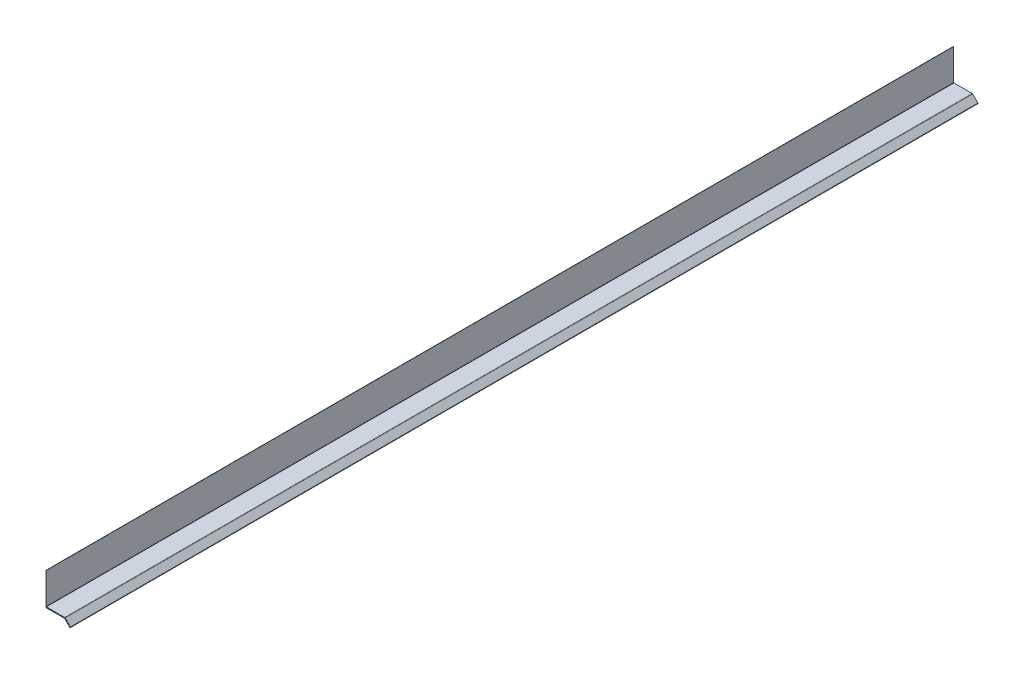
ISO-10303-21;
HEADER;
FILE_DESCRIPTION(('STEP AP214'),'2;1');
FILE_NAME('part.step','',(''),(''),'','','');
FILE_SCHEMA(('AUTOMOTIVE_DESIGN { 1 0 10303 214 1 1 1 1 }'));
ENDSEC;
DATA;
#1=APPLICATION_CONTEXT('core data for automotive mechanical design processes');
#2=APPLICATION_PROTOCOL_DEFINITION('international standard','automotive_design',2000,#1);
#3=PRODUCT_CONTEXT('',#1,'mechanical');
#4=PRODUCT('Part','Part','',(#3));
#5=PRODUCT_RELATED_PRODUCT_CATEGORY('part','',(#4));
#6=PRODUCT_DEFINITION_FORMATION('','',#4);
#7=PRODUCT_DEFINITION_CONTEXT('part definition',#1,'design');
#8=PRODUCT_DEFINITION('design','',#6,#7);
#9=PRODUCT_DEFINITION_SHAPE('','',#8);
#10=(LENGTH_UNIT() NAMED_UNIT(*) SI_UNIT(.MILLI.,.METRE.));
#11=(NAMED_UNIT(*) PLANE_ANGLE_UNIT() SI_UNIT($,.RADIAN.));
#12=(NAMED_UNIT(*) SI_UNIT($,.STERADIAN.) SOLID_ANGLE_UNIT());
#13=UNCERTAINTY_MEASURE_WITH_UNIT(LENGTH_MEASURE(1.E-05),#10,'distance_accuracy_value','');
#14=(GEOMETRIC_REPRESENTATION_CONTEXT(3) GLOBAL_UNCERTAINTY_ASSIGNED_CONTEXT((#13)) GLOBAL_UNIT_ASSIGNED_CONTEXT((#10,
#11,#12)) REPRESENTATION_CONTEXT('',''));
#15=CARTESIAN_POINT('',(0.,0.,0.));
#16=DIRECTION('',(0.,0.,1.));
#17=DIRECTION('',(1.,0.,0.));
#18=AXIS2_PLACEMENT_3D('',#15,#16,#17);
#19=CARTESIAN_POINT('',(41.0712069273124,-0.999999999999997,2000.));
#20=DIRECTION('',(0.,-1.,0.));
#21=DIRECTION('',(1.,0.,0.));
#22=AXIS2_PLACEMENT_3D('',#19,#20,#21);
#23=PLANE('',#22);
#24=DIRECTION('',(-1.,0.,0.));
#25=VECTOR('',#24,1.);
#26=CARTESIAN_POINT('',(41.0712069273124,-0.999999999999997,0.));
#27=LINE('',#26,#25);
#28=CARTESIAN_POINT('',(41.0712069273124,-0.999999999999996,0.));
#29=VERTEX_POINT('',#28);
#30=CARTESIAN_POINT('',(0.363113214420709,-1.,0.));
#31=VERTEX_POINT('',#30);
#32=EDGE_CURVE('E194',#29,#31,#27,.T.);
#33=ORIENTED_EDGE('',*,*,#32,.T.);
#34=DIRECTION('',(0.,0.,-1.));
#35=VECTOR('',#34,1.);
#36=CARTESIAN_POINT('',(0.363113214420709,-1.,2000.));
#37=LINE('',#36,#35);
#38=CARTESIAN_POINT('',(0.363113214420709,-1.,2000.));
#39=VERTEX_POINT('',#38);
#40=EDGE_CURVE('E11',#39,#31,#37,.T.);
#41=ORIENTED_EDGE('',*,*,#40,.F.);
#42=DIRECTION('',(-1.,0.,0.));
#43=VECTOR('',#42,1.);
#44=CARTESIAN_POINT('',(41.0712069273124,-0.999999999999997,2000.));
#45=LINE('',#44,#43);
#46=CARTESIAN_POINT('',(41.0712069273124,-0.999999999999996,2000.));
#47=VERTEX_POINT('',#46);
#48=EDGE_CURVE('E122',#47,#39,#45,.T.);
#49=ORIENTED_EDGE('',*,*,#48,.F.);
#50=DIRECTION('',(0.,0.,-1.));
#51=VECTOR('',#50,1.);
#52=CARTESIAN_POINT('',(41.0712069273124,-0.999999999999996,2000.));
#53=LINE('',#52,#51);
#54=EDGE_CURVE('E190',#47,#29,#53,.T.);
#55=ORIENTED_EDGE('',*,*,#54,.T.);
#56=EDGE_LOOP('',(#33,#41,#49,#55));
#57=FACE_BOUND('',#56,.T.);
#58=ADVANCED_FACE('F33',(#57),#23,.F.);
#59=CARTESIAN_POINT('',(0.363113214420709,-1.508,2000.));
#60=DIRECTION('',(-1.,0.,0.));
#61=DIRECTION('',(0.,0.,1.));
#62=AXIS2_PLACEMENT_3D('',#59,#60,#61);
#63=PLANE('',#62);
#64=DIRECTION('',(0.,1.,0.));
#65=VECTOR('',#64,1.);
#66=CARTESIAN_POINT('',(0.363113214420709,-1.508,0.));
#67=LINE('',#66,#65);
#68=CARTESIAN_POINT('',(0.363113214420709,-1.508,0.));
#69=VERTEX_POINT('',#68);
#70=EDGE_CURVE('E197',#69,#31,#67,.T.);
#71=ORIENTED_EDGE('',*,*,#70,.F.);
#72=DIRECTION('',(0.,0.,-1.));
#73=VECTOR('',#72,1.);
#74=CARTESIAN_POINT('',(0.363113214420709,-1.508,2000.));
#75=LINE('',#74,#73);
#76=CARTESIAN_POINT('',(0.363113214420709,-1.508,2000.));
#77=VERTEX_POINT('',#76);
#78=EDGE_CURVE('E41',#77,#69,#75,.T.);
#79=ORIENTED_EDGE('',*,*,#78,.F.);
#80=DIRECTION('',(0.,1.,0.));
#81=VECTOR('',#80,1.);
#82=CARTESIAN_POINT('',(0.363113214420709,-1.508,2000.));
#83=LINE('',#82,#81);
#84=EDGE_CURVE('E294',#77,#39,#83,.T.);
#85=ORIENTED_EDGE('',*,*,#84,.T.);
#86=ORIENTED_EDGE('',*,*,#40,.T.);
#87=EDGE_LOOP('',(#71,#79,#85,#86));
#88=FACE_BOUND('',#87,.T.);
#89=ADVANCED_FACE('F281',(#88),#63,.T.);
#90=CARTESIAN_POINT('',(41.0712069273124,-1.508,2000.));
#91=DIRECTION('',(0.,-1.,0.));
#92=DIRECTION('',(1.,0.,0.));
#93=AXIS2_PLACEMENT_3D('',#90,#91,#92);
#94=PLANE('',#93);
#95=DIRECTION('',(-1.,0.,0.));
#96=VECTOR('',#95,1.);
#97=CARTESIAN_POINT('',(41.0712069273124,-1.508,0.));
#98=LINE('',#97,#96);
#99=CARTESIAN_POINT('',(41.0712069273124,-1.508,0.));
#100=VERTEX_POINT('',#99);
#101=EDGE_CURVE('E200',#100,#69,#98,.T.);
#102=ORIENTED_EDGE('',*,*,#101,.F.);
#103=DIRECTION('',(0.,0.,-1.));
#104=VECTOR('',#103,1.);
#105=CARTESIAN_POINT('',(41.0712069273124,-1.508,2000.));
#106=LINE('',#105,#104);
#107=CARTESIAN_POINT('',(41.0712069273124,-1.508,2000.));
#108=VERTEX_POINT('',#107);
#109=EDGE_CURVE('E271',#108,#100,#106,.T.);
#110=ORIENTED_EDGE('',*,*,#109,.F.);
#111=DIRECTION('',(-1.,0.,0.));
#112=VECTOR('',#111,1.);
#113=CARTESIAN_POINT('',(41.0712069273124,-1.508,2000.));
#114=LINE('',#113,#112);
#115=EDGE_CURVE('E278',#108,#77,#114,.T.);
#116=ORIENTED_EDGE('',*,*,#115,.T.);
#117=ORIENTED_EDGE('',*,*,#78,.T.);
#118=EDGE_LOOP('',(#102,#110,#116,#117));
#119=FACE_BOUND('',#118,.T.);
#120=ADVANCED_FACE('F276',(#119),#94,.T.);
#121=CARTESIAN_POINT('',(52.2965270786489,-12.7333201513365,2000.));
#122=DIRECTION('',(-0.707106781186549,-0.707106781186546,0.));
#123=DIRECTION('',(0.707106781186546,-0.707106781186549,0.));
#124=AXIS2_PLACEMENT_3D('',#121,#122,#123);
#125=PLANE('',#124);
#126=DIRECTION('',(-0.707106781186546,0.707106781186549,0.));
#127=VECTOR('',#126,1.);
#128=CARTESIAN_POINT('',(52.2965270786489,-12.7333201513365,0.));
#129=LINE('',#128,#127);
#130=CARTESIAN_POINT('',(52.2965270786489,-12.7333201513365,0.));
#131=VERTEX_POINT('',#130);
#132=EDGE_CURVE('E203',#131,#100,#129,.T.);
#133=ORIENTED_EDGE('',*,*,#132,.F.);
#134=DIRECTION('',(0.,0.,-1.));
#135=VECTOR('',#134,1.);
#136=CARTESIAN_POINT('',(52.2965270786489,-12.7333201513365,2000.));
#137=LINE('',#136,#135);
#138=CARTESIAN_POINT('',(52.2965270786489,-12.7333201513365,2000.));
#139=VERTEX_POINT('',#138);
#140=EDGE_CURVE('E269',#139,#131,#137,.T.);
#141=ORIENTED_EDGE('',*,*,#140,.F.);
#142=DIRECTION('',(-0.707106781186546,0.707106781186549,0.));
#143=VECTOR('',#142,1.);
#144=CARTESIAN_POINT('',(52.2965270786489,-12.7333201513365,2000.));
#145=LINE('',#144,#143);
#146=EDGE_CURVE('E291',#139,#108,#145,.T.);
#147=ORIENTED_EDGE('',*,*,#146,.T.);
#148=ORIENTED_EDGE('',*,*,#109,.T.);
#149=EDGE_LOOP('',(#133,#141,#147,#148));
#150=FACE_BOUND('',#149,.T.);
#151=ADVANCED_FACE('F288',(#150),#125,.T.);
#152=CARTESIAN_POINT('',(53.0092907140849,-12.0205565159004,2000.));
#153=DIRECTION('',(0.,0.,-1.));
#154=DIRECTION('',(-1.,0.,0.));
#155=AXIS2_PLACEMENT_3D('',#152,#153,#154);
#156=CYLINDRICAL_SURFACE('',#155,1.008);
#157=CARTESIAN_POINT('',(53.0092907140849,-12.0205565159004,0.));
#158=DIRECTION('',(0.,0.,1.));
#159=DIRECTION('',(1.,0.,0.));
#160=AXIS2_PLACEMENT_3D('',#157,#158,#159);
#161=CIRCLE('',#160,1.008);
#162=CARTESIAN_POINT('',(53.7220543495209,-11.3077928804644,0.));
#163=VERTEX_POINT('',#162);
#164=EDGE_CURVE('E206',#163,#131,#161,.F.);
#165=ORIENTED_EDGE('',*,*,#164,.F.);
#166=DIRECTION('',(0.,0.,-1.));
#167=VECTOR('',#166,1.);
#168=CARTESIAN_POINT('',(53.7220543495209,-11.3077928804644,2000.));
#169=LINE('',#168,#167);
#170=CARTESIAN_POINT('',(53.7220543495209,-11.3077928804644,2000.));
#171=VERTEX_POINT('',#170);
#172=EDGE_CURVE('E267',#171,#163,#169,.T.);
#173=ORIENTED_EDGE('',*,*,#172,.F.);
#174=CARTESIAN_POINT('',(53.0092907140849,-12.0205565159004,2000.));
#175=DIRECTION('',(0.,0.,1.));
#176=DIRECTION('',(1.,0.,0.));
#177=AXIS2_PLACEMENT_3D('',#174,#175,#176);
#178=CIRCLE('',#177,1.008);
#179=EDGE_CURVE('E296',#171,#139,#178,.F.);
#180=ORIENTED_EDGE('',*,*,#179,.T.);
#181=ORIENTED_EDGE('',*,*,#140,.T.);
#182=EDGE_LOOP('',(#165,#173,#180,#181));
#183=FACE_BOUND('',#182,.T.);
#184=ADVANCED_FACE('F359',(#183),#156,.T.);
#185=CARTESIAN_POINT('',(42.3526307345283,0.061630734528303,2000.));
#186=DIRECTION('',(0.707106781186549,0.707106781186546,0.));
#187=DIRECTION('',(-0.707106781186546,0.707106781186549,0.));
#188=AXIS2_PLACEMENT_3D('',#185,#186,#187);
#189=PLANE('',#188);
#190=DIRECTION('',(0.707106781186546,-0.707106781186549,0.));
#191=VECTOR('',#190,1.);
#192=CARTESIAN_POINT('',(42.3526307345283,0.061630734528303,0.));
#193=LINE('',#192,#191);
#194=CARTESIAN_POINT('',(42.3526307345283,0.061630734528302,0.));
#195=VERTEX_POINT('',#194);
#196=EDGE_CURVE('E209',#195,#163,#193,.T.);
#197=ORIENTED_EDGE('',*,*,#196,.F.);
#198=DIRECTION('',(0.,0.,-1.));
#199=VECTOR('',#198,1.);
#200=CARTESIAN_POINT('',(42.3526307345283,0.061630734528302,2000.));
#201=LINE('',#200,#199);
#202=CARTESIAN_POINT('',(42.3526307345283,0.061630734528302,2000.));
#203=VERTEX_POINT('',#202);
#204=EDGE_CURVE('E265',#203,#195,#201,.T.);
#205=ORIENTED_EDGE('',*,*,#204,.F.);
#206=DIRECTION('',(0.707106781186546,-0.707106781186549,0.));
#207=VECTOR('',#206,1.);
#208=CARTESIAN_POINT('',(42.3526307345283,0.061630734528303,2000.));
#209=LINE('',#208,#207);
#210=EDGE_CURVE('E302',#203,#171,#209,.T.);
#211=ORIENTED_EDGE('',*,*,#210,.T.);
#212=ORIENTED_EDGE('',*,*,#172,.T.);
#213=EDGE_LOOP('',(#197,#205,#211,#212));
#214=FACE_BOUND('',#213,.T.);
#215=ADVANCED_FACE('F362',(#214),#189,.T.);
#216=CARTESIAN_POINT('',(41.275,-1.016,2000.));
#217=DIRECTION('',(0.,0.,-1.));
#218=DIRECTION('',(-1.,0.,0.));
#219=AXIS2_PLACEMENT_3D('',#216,#217,#218);
#220=CYLINDRICAL_SURFACE('',#219,1.524);
#221=CARTESIAN_POINT('',(41.275,-1.016,0.));
#222=DIRECTION('',(0.,0.,1.));
#223=DIRECTION('',(1.,0.,0.));
#224=AXIS2_PLACEMENT_3D('',#221,#222,#223);
#225=CIRCLE('',#224,1.524);
#226=CARTESIAN_POINT('',(41.275,0.508000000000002,0.));
#227=VERTEX_POINT('',#226);
#228=EDGE_CURVE('E212',#227,#195,#225,.F.);
#229=ORIENTED_EDGE('',*,*,#228,.F.);
#230=DIRECTION('',(0.,0.,-1.));
#231=VECTOR('',#230,1.);
#232=CARTESIAN_POINT('',(41.275,0.508000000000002,2000.));
#233=LINE('',#232,#231);
#234=CARTESIAN_POINT('',(41.275,0.508000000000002,2000.));
#235=VERTEX_POINT('',#234);
#236=EDGE_CURVE('E263',#235,#227,#233,.T.);
#237=ORIENTED_EDGE('',*,*,#236,.F.);
#238=CARTESIAN_POINT('',(41.275,-1.016,2000.));
#239=DIRECTION('',(0.,0.,1.));
#240=DIRECTION('',(1.,0.,0.));
#241=AXIS2_PLACEMENT_3D('',#238,#239,#240);
#242=CIRCLE('',#241,1.524);
#243=EDGE_CURVE('E305',#235,#203,#242,.F.);
#244=ORIENTED_EDGE('',*,*,#243,.T.);
#245=ORIENTED_EDGE('',*,*,#204,.T.);
#246=EDGE_LOOP('',(#229,#237,#244,#245));
#247=FACE_BOUND('',#246,.T.);
#248=ADVANCED_FACE('F366',(#247),#220,.T.);
#249=CARTESIAN_POINT('',(1.,0.508,2000.));
#250=DIRECTION('',(0.,1.,0.));
#251=DIRECTION('',(0.,0.,1.));
#252=AXIS2_PLACEMENT_3D('',#249,#250,#251);
#253=PLANE('',#252);
#254=DIRECTION('',(1.,0.,0.));
#255=VECTOR('',#254,1.);
#256=CARTESIAN_POINT('',(1.,0.508,0.));
#257=LINE('',#256,#255);
#258=CARTESIAN_POINT('',(1.,0.508,0.));
#259=VERTEX_POINT('',#258);
#260=EDGE_CURVE('E215',#259,#227,#257,.T.);
#261=ORIENTED_EDGE('',*,*,#260,.F.);
#262=DIRECTION('',(0.,0.,-1.));
#263=VECTOR('',#262,1.);
#264=CARTESIAN_POINT('',(1.,0.508,2000.));
#265=LINE('',#264,#263);
#266=CARTESIAN_POINT('',(1.,0.508,2000.));
#267=VERTEX_POINT('',#266);
#268=EDGE_CURVE('E261',#267,#259,#265,.T.);
#269=ORIENTED_EDGE('',*,*,#268,.F.);
#270=DIRECTION('',(1.,0.,0.));
#271=VECTOR('',#270,1.);
#272=CARTESIAN_POINT('',(1.,0.508,2000.));
#273=LINE('',#272,#271);
#274=EDGE_CURVE('E308',#267,#235,#273,.T.);
#275=ORIENTED_EDGE('',*,*,#274,.T.);
#276=ORIENTED_EDGE('',*,*,#236,.T.);
#277=EDGE_LOOP('',(#261,#269,#275,#276));
#278=FACE_BOUND('',#277,.T.);
#279=ADVANCED_FACE('F370',(#278),#253,.T.);
#280=CARTESIAN_POINT('',(1.,1.,2000.));
#281=DIRECTION('',(0.,0.,-1.));
#282=DIRECTION('',(-1.,0.,0.));
#283=AXIS2_PLACEMENT_3D('',#280,#281,#282);
#284=CYLINDRICAL_SURFACE('',#283,0.492);
#285=CARTESIAN_POINT('',(1.,1.,0.));
#286=DIRECTION('',(0.,0.,1.));
#287=DIRECTION('',(1.,0.,0.));
#288=AXIS2_PLACEMENT_3D('',#285,#286,#287);
#289=CIRCLE('',#288,0.492);
#290=CARTESIAN_POINT('',(0.508,1.,0.));
#291=VERTEX_POINT('',#290);
#292=EDGE_CURVE('E218',#291,#259,#289,.T.);
#293=ORIENTED_EDGE('',*,*,#292,.F.);
#294=DIRECTION('',(0.,0.,-1.));
#295=VECTOR('',#294,1.);
#296=CARTESIAN_POINT('',(0.508,1.,2000.));
#297=LINE('',#296,#295);
#298=CARTESIAN_POINT('',(0.508,1.,2000.));
#299=VERTEX_POINT('',#298);
#300=EDGE_CURVE('E259',#299,#291,#297,.T.);
#301=ORIENTED_EDGE('',*,*,#300,.F.);
#302=CARTESIAN_POINT('',(1.,1.,2000.));
#303=DIRECTION('',(0.,0.,1.));
#304=DIRECTION('',(1.,0.,0.));
#305=AXIS2_PLACEMENT_3D('',#302,#303,#304);
#306=CIRCLE('',#305,0.492);
#307=EDGE_CURVE('E311',#299,#267,#306,.T.);
#308=ORIENTED_EDGE('',*,*,#307,.T.);
#309=ORIENTED_EDGE('',*,*,#268,.T.);
#310=EDGE_LOOP('',(#293,#301,#308,#309));
#311=FACE_BOUND('',#310,.T.);
#312=ADVANCED_FACE('F374',(#311),#284,.F.);
#313=CARTESIAN_POINT('',(0.508,1.,2000.));
#314=DIRECTION('',(1.,0.,0.));
#315=DIRECTION('',(0.,0.,-1.));
#316=AXIS2_PLACEMENT_3D('',#313,#314,#315);
#317=PLANE('',#316);
#318=DIRECTION('',(0.,1.,0.));
#319=VECTOR('',#318,1.);
#320=CARTESIAN_POINT('',(0.508,1.,0.));
#321=LINE('',#320,#319);
#322=CARTESIAN_POINT('',(0.508,69.85,0.));
#323=VERTEX_POINT('',#322);
#324=EDGE_CURVE('E221',#323,#291,#321,.F.);
#325=ORIENTED_EDGE('',*,*,#324,.F.);
#326=DIRECTION('',(0.,0.,-1.));
#327=VECTOR('',#326,1.);
#328=CARTESIAN_POINT('',(0.508,69.85,2000.));
#329=LINE('',#328,#327);
#330=CARTESIAN_POINT('',(0.508,69.85,2000.));
#331=VERTEX_POINT('',#330);
#332=EDGE_CURVE('E257',#331,#323,#329,.T.);
#333=ORIENTED_EDGE('',*,*,#332,.F.);
#334=DIRECTION('',(0.,1.,0.));
#335=VECTOR('',#334,1.);
#336=CARTESIAN_POINT('',(0.508,1.,2000.));
#337=LINE('',#336,#335);
#338=EDGE_CURVE('E314',#331,#299,#337,.F.);
#339=ORIENTED_EDGE('',*,*,#338,.T.);
#340=ORIENTED_EDGE('',*,*,#300,.T.);
#341=EDGE_LOOP('',(#325,#333,#339,#340));
#342=FACE_BOUND('',#341,.T.);
#343=ADVANCED_FACE('F378',(#342),#317,.T.);
#344=CARTESIAN_POINT('',(0.,69.85,2000.));
#345=DIRECTION('',(0.,1.,0.));
#346=DIRECTION('',(0.,0.,1.));
#347=AXIS2_PLACEMENT_3D('',#344,#345,#346);
#348=PLANE('',#347);
#349=DIRECTION('',(1.,0.,0.));
#350=VECTOR('',#349,1.);
#351=CARTESIAN_POINT('',(0.,69.85,0.));
#352=LINE('',#351,#350);
#353=CARTESIAN_POINT('',(0.,69.85,0.));
#354=VERTEX_POINT('',#353);
#355=EDGE_CURVE('E224',#354,#323,#352,.T.);
#356=ORIENTED_EDGE('',*,*,#355,.F.);
#357=DIRECTION('',(0.,0.,-1.));
#358=VECTOR('',#357,1.);
#359=CARTESIAN_POINT('',(0.,69.85,2000.));
#360=LINE('',#359,#358);
#361=CARTESIAN_POINT('',(0.,69.85,2000.));
#362=VERTEX_POINT('',#361);
#363=EDGE_CURVE('E255',#362,#354,#360,.T.);
#364=ORIENTED_EDGE('',*,*,#363,.F.);
#365=DIRECTION('',(1.,0.,0.));
#366=VECTOR('',#365,1.);
#367=CARTESIAN_POINT('',(0.,69.85,2000.));
#368=LINE('',#367,#366);
#369=EDGE_CURVE('E317',#362,#331,#368,.T.);
#370=ORIENTED_EDGE('',*,*,#369,.T.);
#371=ORIENTED_EDGE('',*,*,#332,.T.);
#372=EDGE_LOOP('',(#356,#364,#370,#371));
#373=FACE_BOUND('',#372,.T.);
#374=ADVANCED_FACE('F382',(#373),#348,.T.);
#375=CARTESIAN_POINT('',(0.,1.,2000.));
#376=DIRECTION('',(1.,0.,0.));
#377=DIRECTION('',(0.,0.,-1.));
#378=AXIS2_PLACEMENT_3D('',#375,#376,#377);
#379=PLANE('',#378);
#380=DIRECTION('',(0.,-1.,0.));
#381=VECTOR('',#380,1.);
#382=CARTESIAN_POINT('',(0.,1.,0.));
#383=LINE('',#382,#381);
#384=CARTESIAN_POINT('',(0.,1.,0.));
#385=VERTEX_POINT('',#384);
#386=EDGE_CURVE('E227',#354,#385,#383,.T.);
#387=ORIENTED_EDGE('',*,*,#386,.T.);
#388=DIRECTION('',(0.,0.,-1.));
#389=VECTOR('',#388,1.);
#390=CARTESIAN_POINT('',(0.,1.,2000.));
#391=LINE('',#390,#389);
#392=CARTESIAN_POINT('',(0.,1.,2000.));
#393=VERTEX_POINT('',#392);
#394=EDGE_CURVE('E252',#393,#385,#391,.T.);
#395=ORIENTED_EDGE('',*,*,#394,.F.);
#396=DIRECTION('',(0.,-1.,0.));
#397=VECTOR('',#396,1.);
#398=CARTESIAN_POINT('',(0.,1.,2000.));
#399=LINE('',#398,#397);
#400=EDGE_CURVE('E320',#362,#393,#399,.T.);
#401=ORIENTED_EDGE('',*,*,#400,.F.);
#402=ORIENTED_EDGE('',*,*,#363,.T.);
#403=EDGE_LOOP('',(#387,#395,#401,#402));
#404=FACE_BOUND('',#403,.T.);
#405=ADVANCED_FACE('F386',(#404),#379,.F.);
#406=CARTESIAN_POINT('',(1.,1.,2000.));
#407=DIRECTION('',(0.,0.,-1.));
#408=DIRECTION('',(-1.,0.,0.));
#409=AXIS2_PLACEMENT_3D('',#406,#407,#408);
#410=CYLINDRICAL_SURFACE('',#409,1.);
#411=CARTESIAN_POINT('',(1.,1.,0.));
#412=DIRECTION('',(0.,0.,1.));
#413=DIRECTION('',(1.,0.,0.));
#414=AXIS2_PLACEMENT_3D('',#411,#412,#413);
#415=CIRCLE('',#414,1.);
#416=CARTESIAN_POINT('',(1.,0.,0.));
#417=VERTEX_POINT('',#416);
#418=EDGE_CURVE('E229',#385,#417,#415,.T.);
#419=ORIENTED_EDGE('',*,*,#418,.T.);
#420=DIRECTION('',(0.,0.,-1.));
#421=VECTOR('',#420,1.);
#422=CARTESIAN_POINT('',(1.,0.,2000.));
#423=LINE('',#422,#421);
#424=CARTESIAN_POINT('',(1.,0.,2000.));
#425=VERTEX_POINT('',#424);
#426=EDGE_CURVE('E249',#425,#417,#423,.T.);
#427=ORIENTED_EDGE('',*,*,#426,.F.);
#428=CARTESIAN_POINT('',(1.,1.,2000.));
#429=DIRECTION('',(0.,0.,1.));
#430=DIRECTION('',(1.,0.,0.));
#431=AXIS2_PLACEMENT_3D('',#428,#429,#430);
#432=CIRCLE('',#431,1.);
#433=EDGE_CURVE('E322',#393,#425,#432,.T.);
#434=ORIENTED_EDGE('',*,*,#433,.F.);
#435=ORIENTED_EDGE('',*,*,#394,.T.);
#436=EDGE_LOOP('',(#419,#427,#434,#435));
#437=FACE_BOUND('',#436,.T.);
#438=ADVANCED_FACE('F390',(#437),#410,.T.);
#439=CARTESIAN_POINT('',(1.,0.,2000.));
#440=DIRECTION('',(0.,1.,0.));
#441=DIRECTION('',(0.,0.,1.));
#442=AXIS2_PLACEMENT_3D('',#439,#440,#441);
#443=PLANE('',#442);
#444=DIRECTION('',(1.,0.,0.));
#445=VECTOR('',#444,1.);
#446=CARTESIAN_POINT('',(1.,0.,0.));
#447=LINE('',#446,#445);
#448=CARTESIAN_POINT('',(41.275,0.,0.));
#449=VERTEX_POINT('',#448);
#450=EDGE_CURVE('E231',#417,#449,#447,.T.);
#451=ORIENTED_EDGE('',*,*,#450,.T.);
#452=DIRECTION('',(0.,0.,-1.));
#453=VECTOR('',#452,1.);
#454=CARTESIAN_POINT('',(41.275,0.,2000.));
#455=LINE('',#454,#453);
#456=CARTESIAN_POINT('',(41.275,0.,2000.));
#457=VERTEX_POINT('',#456);
#458=EDGE_CURVE('E246',#457,#449,#455,.T.);
#459=ORIENTED_EDGE('',*,*,#458,.F.);
#460=DIRECTION('',(1.,0.,0.));
#461=VECTOR('',#460,1.);
#462=CARTESIAN_POINT('',(1.,0.,2000.));
#463=LINE('',#462,#461);
#464=EDGE_CURVE('E324',#425,#457,#463,.T.);
#465=ORIENTED_EDGE('',*,*,#464,.F.);
#466=ORIENTED_EDGE('',*,*,#426,.T.);
#467=EDGE_LOOP('',(#451,#459,#465,#466));
#468=FACE_BOUND('',#467,.T.);
#469=ADVANCED_FACE('F394',(#468),#443,.F.);
#470=CARTESIAN_POINT('',(41.275,-1.016,2000.));
#471=DIRECTION('',(0.,0.,-1.));
#472=DIRECTION('',(-1.,0.,0.));
#473=AXIS2_PLACEMENT_3D('',#470,#471,#472);
#474=CYLINDRICAL_SURFACE('',#473,1.016);
#475=CARTESIAN_POINT('',(41.275,-1.016,0.));
#476=DIRECTION('',(0.,0.,-1.));
#477=DIRECTION('',(1.,0.,0.));
#478=AXIS2_PLACEMENT_3D('',#475,#476,#477);
#479=CIRCLE('',#478,1.016);
#480=CARTESIAN_POINT('',(41.9934204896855,-0.297579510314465,0.));
#481=VERTEX_POINT('',#480);
#482=EDGE_CURVE('E233',#449,#481,#479,.T.);
#483=ORIENTED_EDGE('',*,*,#482,.T.);
#484=DIRECTION('',(0.,0.,-1.));
#485=VECTOR('',#484,1.);
#486=CARTESIAN_POINT('',(41.9934204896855,-0.297579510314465,2000.));
#487=LINE('',#486,#485);
#488=CARTESIAN_POINT('',(41.9934204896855,-0.297579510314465,2000.));
#489=VERTEX_POINT('',#488);
#490=EDGE_CURVE('E243',#489,#481,#487,.T.);
#491=ORIENTED_EDGE('',*,*,#490,.F.);
#492=CARTESIAN_POINT('',(41.275,-1.016,2000.));
#493=DIRECTION('',(0.,0.,-1.));
#494=DIRECTION('',(1.,0.,0.));
#495=AXIS2_PLACEMENT_3D('',#492,#493,#494);
#496=CIRCLE('',#495,1.016);
#497=EDGE_CURVE('E326',#457,#489,#496,.T.);
#498=ORIENTED_EDGE('',*,*,#497,.F.);
#499=ORIENTED_EDGE('',*,*,#458,.T.);
#500=EDGE_LOOP('',(#483,#491,#498,#499));
#501=FACE_BOUND('',#500,.T.);
#502=ADVANCED_FACE('F332',(#501),#474,.F.);
#503=CARTESIAN_POINT('',(41.9934204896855,-0.297579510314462,2000.));
#504=DIRECTION('',(0.707106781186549,0.707106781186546,0.));
#505=DIRECTION('',(-0.707106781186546,0.707106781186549,0.));
#506=AXIS2_PLACEMENT_3D('',#503,#504,#505);
#507=PLANE('',#506);
#508=DIRECTION('',(0.707106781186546,-0.707106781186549,0.));
#509=VECTOR('',#508,1.);
#510=CARTESIAN_POINT('',(41.9934204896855,-0.297579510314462,0.));
#511=LINE('',#510,#509);
#512=CARTESIAN_POINT('',(53.3628441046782,-11.6670031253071,0.));
#513=VERTEX_POINT('',#512);
#514=EDGE_CURVE('E235',#481,#513,#511,.T.);
#515=ORIENTED_EDGE('',*,*,#514,.T.);
#516=DIRECTION('',(0.,0.,-1.));
#517=VECTOR('',#516,1.);
#518=CARTESIAN_POINT('',(53.3628441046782,-11.6670031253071,2000.));
#519=LINE('',#518,#517);
#520=CARTESIAN_POINT('',(53.3628441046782,-11.6670031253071,2000.));
#521=VERTEX_POINT('',#520);
#522=EDGE_CURVE('E185',#521,#513,#519,.T.);
#523=ORIENTED_EDGE('',*,*,#522,.F.);
#524=DIRECTION('',(0.707106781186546,-0.707106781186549,0.));
#525=VECTOR('',#524,1.);
#526=CARTESIAN_POINT('',(41.9934204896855,-0.297579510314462,2000.));
#527=LINE('',#526,#525);
#528=EDGE_CURVE('E176',#489,#521,#527,.T.);
#529=ORIENTED_EDGE('',*,*,#528,.F.);
#530=ORIENTED_EDGE('',*,*,#490,.T.);
#531=EDGE_LOOP('',(#515,#523,#529,#530));
#532=FACE_BOUND('',#531,.T.);
#533=ADVANCED_FACE('F336',(#532),#507,.F.);
#534=CARTESIAN_POINT('',(53.0092907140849,-12.0205565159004,2000.));
#535=DIRECTION('',(0.,0.,-1.));
#536=DIRECTION('',(-1.,0.,0.));
#537=AXIS2_PLACEMENT_3D('',#534,#535,#536);
#538=CYLINDRICAL_SURFACE('',#537,0.500000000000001);
#539=CARTESIAN_POINT('',(53.0092907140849,-12.0205565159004,0.));
#540=DIRECTION('',(0.,0.,-1.));
#541=DIRECTION('',(-1.,0.,0.));
#542=AXIS2_PLACEMENT_3D('',#539,#540,#541);
#543=CIRCLE('',#542,0.500000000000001);
#544=CARTESIAN_POINT('',(52.6557373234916,-12.3741099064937,0.));
#545=VERTEX_POINT('',#544);
#546=EDGE_CURVE('E184',#513,#545,#543,.T.);
#547=ORIENTED_EDGE('',*,*,#546,.T.);
#548=DIRECTION('',(0.,0.,-1.));
#549=VECTOR('',#548,1.);
#550=CARTESIAN_POINT('',(52.6557373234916,-12.3741099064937,2000.));
#551=LINE('',#550,#549);
#552=CARTESIAN_POINT('',(52.6557373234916,-12.3741099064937,2000.));
#553=VERTEX_POINT('',#552);
#554=EDGE_CURVE('E181',#553,#545,#551,.T.);
#555=ORIENTED_EDGE('',*,*,#554,.F.);
#556=CARTESIAN_POINT('',(53.0092907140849,-12.0205565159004,2000.));
#557=DIRECTION('',(0.,0.,-1.));
#558=DIRECTION('',(-1.,0.,0.));
#559=AXIS2_PLACEMENT_3D('',#556,#557,#558);
#560=CIRCLE('',#559,0.500000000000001);
#561=EDGE_CURVE('E170',#521,#553,#560,.T.);
#562=ORIENTED_EDGE('',*,*,#561,.F.);
#563=ORIENTED_EDGE('',*,*,#522,.T.);
#564=EDGE_LOOP('',(#547,#555,#562,#563));
#565=FACE_BOUND('',#564,.T.);
#566=ADVANCED_FACE('F182',(#565),#538,.F.);
#567=CARTESIAN_POINT('',(52.6557373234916,-12.3741099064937,2000.));
#568=DIRECTION('',(-0.707106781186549,-0.707106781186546,0.));
#569=DIRECTION('',(0.707106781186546,-0.707106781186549,0.));
#570=AXIS2_PLACEMENT_3D('',#567,#568,#569);
#571=PLANE('',#570);
#572=DIRECTION('',(-0.707106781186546,0.707106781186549,0.));
#573=VECTOR('',#572,1.);
#574=CARTESIAN_POINT('',(52.6557373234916,-12.3741099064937,0.));
#575=LINE('',#574,#573);
#576=CARTESIAN_POINT('',(41.4304171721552,-1.14878975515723,0.));
#577=VERTEX_POINT('',#576);
#578=EDGE_CURVE('E110',#545,#577,#575,.T.);
#579=ORIENTED_EDGE('',*,*,#578,.T.);
#580=DIRECTION('',(0.,0.,-1.));
#581=VECTOR('',#580,1.);
#582=CARTESIAN_POINT('',(41.4304171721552,-1.14878975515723,2000.));
#583=LINE('',#582,#581);
#584=CARTESIAN_POINT('',(41.4304171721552,-1.14878975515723,2000.));
#585=VERTEX_POINT('',#584);
#586=EDGE_CURVE('E186',#585,#577,#583,.T.);
#587=ORIENTED_EDGE('',*,*,#586,.F.);
#588=DIRECTION('',(-0.707106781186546,0.707106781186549,0.));
#589=VECTOR('',#588,1.);
#590=CARTESIAN_POINT('',(52.6557373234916,-12.3741099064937,2000.));
#591=LINE('',#590,#589);
#592=EDGE_CURVE('E174',#553,#585,#591,.T.);
#593=ORIENTED_EDGE('',*,*,#592,.F.);
#594=ORIENTED_EDGE('',*,*,#554,.T.);
#595=EDGE_LOOP('',(#579,#587,#593,#594));
#596=FACE_BOUND('',#595,.T.);
#597=ADVANCED_FACE('F188',(#596),#571,.F.);
#598=CARTESIAN_POINT('',(41.0712069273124,-1.508,2000.));
#599=DIRECTION('',(0.,0.,-1.));
#600=DIRECTION('',(-1.,0.,0.));
#601=AXIS2_PLACEMENT_3D('',#598,#599,#600);
#602=CYLINDRICAL_SURFACE('',#601,0.508000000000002);
#603=CARTESIAN_POINT('',(41.0712069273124,-1.508,0.));
#604=DIRECTION('',(0.,0.,1.));
#605=DIRECTION('',(-1.,0.,0.));
#606=AXIS2_PLACEMENT_3D('',#603,#604,#605);
#607=CIRCLE('',#606,0.508000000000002);
#608=EDGE_CURVE('E116',#577,#29,#607,.T.);
#609=ORIENTED_EDGE('',*,*,#608,.T.);
#610=ORIENTED_EDGE('',*,*,#54,.F.);
#611=CARTESIAN_POINT('',(41.0712069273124,-1.508,2000.));
#612=DIRECTION('',(0.,0.,1.));
#613=DIRECTION('',(-1.,0.,0.));
#614=AXIS2_PLACEMENT_3D('',#611,#612,#613);
#615=CIRCLE('',#614,0.508000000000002);
#616=EDGE_CURVE('E49',#585,#47,#615,.T.);
#617=ORIENTED_EDGE('',*,*,#616,.F.);
#618=ORIENTED_EDGE('',*,*,#586,.T.);
#619=EDGE_LOOP('',(#609,#610,#617,#618));
#620=FACE_BOUND('',#619,.T.);
#621=ADVANCED_FACE('F338',(#620),#602,.T.);
#622=CARTESIAN_POINT('',(53.0092907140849,-12.0205565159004,2000.));
#623=DIRECTION('',(0.,0.,1.));
#624=DIRECTION('',(1.,0.,0.));
#625=AXIS2_PLACEMENT_3D('',#622,#623,#624);
#626=PLANE('',#625);
#627=ORIENTED_EDGE('',*,*,#48,.T.);
#628=ORIENTED_EDGE('',*,*,#84,.F.);
#629=ORIENTED_EDGE('',*,*,#115,.F.);
#630=ORIENTED_EDGE('',*,*,#146,.F.);
#631=ORIENTED_EDGE('',*,*,#179,.F.);
#632=ORIENTED_EDGE('',*,*,#210,.F.);
#633=ORIENTED_EDGE('',*,*,#243,.F.);
#634=ORIENTED_EDGE('',*,*,#274,.F.);
#635=ORIENTED_EDGE('',*,*,#307,.F.);
#636=ORIENTED_EDGE('',*,*,#338,.F.);
#637=ORIENTED_EDGE('',*,*,#369,.F.);
#638=ORIENTED_EDGE('',*,*,#400,.T.);
#639=ORIENTED_EDGE('',*,*,#433,.T.);
#640=ORIENTED_EDGE('',*,*,#464,.T.);
#641=ORIENTED_EDGE('',*,*,#497,.T.);
#642=ORIENTED_EDGE('',*,*,#528,.T.);
#643=ORIENTED_EDGE('',*,*,#561,.T.);
#644=ORIENTED_EDGE('',*,*,#592,.T.);
#645=ORIENTED_EDGE('',*,*,#616,.T.);
#646=EDGE_LOOP('',(#627,#628,#629,#630,#631,#632,#633,#634,#635,#636,#637,#638,#639,#640,#641,
#642,#643,#644,#645));
#647=FACE_BOUND('',#646,.T.);
#648=ADVANCED_FACE('F172',(#647),#626,.T.);
#649=CARTESIAN_POINT('',(53.0092907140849,-12.0205565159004,0.));
#650=DIRECTION('',(0.,0.,1.));
#651=DIRECTION('',(1.,0.,0.));
#652=AXIS2_PLACEMENT_3D('',#649,#650,#651);
#653=PLANE('',#652);
#654=ORIENTED_EDGE('',*,*,#32,.F.);
#655=ORIENTED_EDGE('',*,*,#608,.F.);
#656=ORIENTED_EDGE('',*,*,#578,.F.);
#657=ORIENTED_EDGE('',*,*,#546,.F.);
#658=ORIENTED_EDGE('',*,*,#514,.F.);
#659=ORIENTED_EDGE('',*,*,#482,.F.);
#660=ORIENTED_EDGE('',*,*,#450,.F.);
#661=ORIENTED_EDGE('',*,*,#418,.F.);
#662=ORIENTED_EDGE('',*,*,#386,.F.);
#663=ORIENTED_EDGE('',*,*,#355,.T.);
#664=ORIENTED_EDGE('',*,*,#324,.T.);
#665=ORIENTED_EDGE('',*,*,#292,.T.);
#666=ORIENTED_EDGE('',*,*,#260,.T.);
#667=ORIENTED_EDGE('',*,*,#228,.T.);
#668=ORIENTED_EDGE('',*,*,#196,.T.);
#669=ORIENTED_EDGE('',*,*,#164,.T.);
#670=ORIENTED_EDGE('',*,*,#132,.T.);
#671=ORIENTED_EDGE('',*,*,#101,.T.);
#672=ORIENTED_EDGE('',*,*,#70,.T.);
#673=EDGE_LOOP('',(#654,#655,#656,#657,#658,#659,#660,#661,#662,#663,#664,#665,#666,#667,#668,
#669,#670,#671,#672));
#674=FACE_BOUND('',#673,.T.);
#675=ADVANCED_FACE('F284',(#674),#653,.F.);
#676=CLOSED_SHELL('',(#58,#89,#120,#151,#184,#215,#248,#279,#312,#343,#374,#405,#438,#469,#502,
#533,#566,#597,#621,#648,#675));
#677=MANIFOLD_SOLID_BREP('B2',#676);
#678=ADVANCED_BREP_SHAPE_REPRESENTATION('',(#18,#677),#14);
#679=SHAPE_DEFINITION_REPRESENTATION(#9,#678);
ENDSEC;
END-ISO-10303-21;
